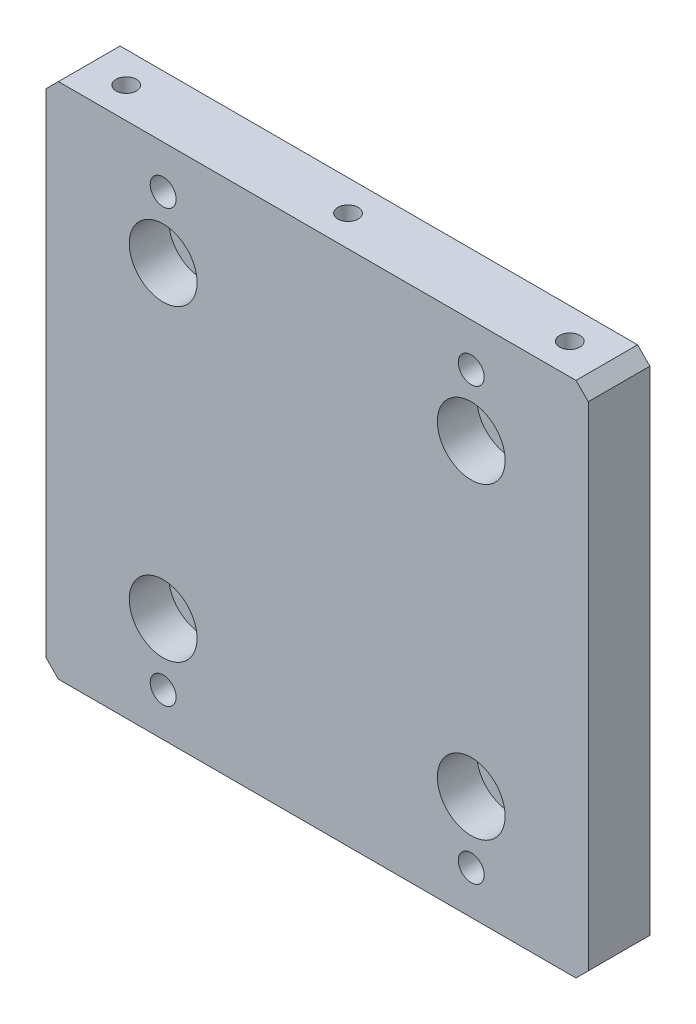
ISO-10303-21;
HEADER;
FILE_DESCRIPTION(('STEP AP214'),'2;1');
FILE_NAME('part.step','',(''),(''),'','','');
FILE_SCHEMA(('AUTOMOTIVE_DESIGN { 1 0 10303 214 1 1 1 1 }'));
ENDSEC;
DATA;
#1=APPLICATION_CONTEXT('core data for automotive mechanical design processes');
#2=APPLICATION_PROTOCOL_DEFINITION('international standard','automotive_design',2000,#1);
#3=PRODUCT_CONTEXT('',#1,'mechanical');
#4=PRODUCT('Part','Part','',(#3));
#5=PRODUCT_RELATED_PRODUCT_CATEGORY('part','',(#4));
#6=PRODUCT_DEFINITION_FORMATION('','',#4);
#7=PRODUCT_DEFINITION_CONTEXT('part definition',#1,'design');
#8=PRODUCT_DEFINITION('design','',#6,#7);
#9=PRODUCT_DEFINITION_SHAPE('','',#8);
#10=(LENGTH_UNIT() NAMED_UNIT(*) SI_UNIT(.MILLI.,.METRE.));
#11=(NAMED_UNIT(*) PLANE_ANGLE_UNIT() SI_UNIT($,.RADIAN.));
#12=(NAMED_UNIT(*) SI_UNIT($,.STERADIAN.) SOLID_ANGLE_UNIT());
#13=UNCERTAINTY_MEASURE_WITH_UNIT(LENGTH_MEASURE(1.E-05),#10,'distance_accuracy_value','');
#14=(GEOMETRIC_REPRESENTATION_CONTEXT(3) GLOBAL_UNCERTAINTY_ASSIGNED_CONTEXT((#13)) GLOBAL_UNIT_ASSIGNED_CONTEXT((#10,
#11,#12)) REPRESENTATION_CONTEXT('',''));
#15=CARTESIAN_POINT('',(0.,0.,0.));
#16=DIRECTION('',(0.,0.,1.));
#17=DIRECTION('',(1.,0.,0.));
#18=AXIS2_PLACEMENT_3D('',#15,#16,#17);
#19=CARTESIAN_POINT('',(-44.0000000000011,42.0000000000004,9.99999999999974));
#20=DIRECTION('',(1.00000000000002,0.,0.));
#21=DIRECTION('',(0.,0.,-1.00000000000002));
#22=AXIS2_PLACEMENT_3D('',#19,#20,#21);
#23=PLANE('',#22);
#24=DIRECTION('',(0.,-1.,0.));
#25=VECTOR('',#24,1.);
#26=CARTESIAN_POINT('',(-44.0000000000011,42.0000000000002,-2.77555756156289E-13));
#27=LINE('',#26,#25);
#28=CARTESIAN_POINT('',(-44.0000000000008,40.0000000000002,0.));
#29=VERTEX_POINT('',#28);
#30=CARTESIAN_POINT('',(-44.0000000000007,-39.9999999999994,0.));
#31=VERTEX_POINT('',#30);
#32=EDGE_CURVE('E214',#29,#31,#27,.T.);
#33=ORIENTED_EDGE('',*,*,#32,.T.);
#34=DIRECTION('',(0.,0.,1.00000000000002));
#35=VECTOR('',#34,1.);
#36=CARTESIAN_POINT('',(-44.0000000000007,-39.9999999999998,10.0000000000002));
#37=LINE('',#36,#35);
#38=CARTESIAN_POINT('',(-44.0000000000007,-39.9999999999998,10.0000000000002));
#39=VERTEX_POINT('',#38);
#40=EDGE_CURVE('E11',#31,#39,#37,.T.);
#41=ORIENTED_EDGE('',*,*,#40,.T.);
#42=DIRECTION('',(0.,-1.,0.));
#43=VECTOR('',#42,1.);
#44=CARTESIAN_POINT('',(-44.0000000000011,42.0000000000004,9.99999999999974));
#45=LINE('',#44,#43);
#46=CARTESIAN_POINT('',(-44.0000000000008,40.0000000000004,10.0000000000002));
#47=VERTEX_POINT('',#46);
#48=EDGE_CURVE('E215',#47,#39,#45,.T.);
#49=ORIENTED_EDGE('',*,*,#48,.F.);
#50=DIRECTION('',(0.,0.,-1.00000000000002));
#51=VECTOR('',#50,1.);
#52=CARTESIAN_POINT('',(-44.0000000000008,40.0000000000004,10.0000000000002));
#53=LINE('',#52,#51);
#54=EDGE_CURVE('E50',#47,#29,#53,.T.);
#55=ORIENTED_EDGE('',*,*,#54,.T.);
#56=EDGE_LOOP('',(#33,#41,#49,#55));
#57=FACE_BOUND('',#56,.T.);
#58=ADVANCED_FACE('F42',(#57),#23,.F.);
#59=CARTESIAN_POINT('',(-44.0000000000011,-41.9999999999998,10.0000000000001));
#60=DIRECTION('',(0.,1.,0.));
#61=DIRECTION('',(-1.00000000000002,0.,0.));
#62=AXIS2_PLACEMENT_3D('',#59,#60,#61);
#63=PLANE('',#62);
#64=DIRECTION('',(1.00000000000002,0.,0.));
#65=VECTOR('',#64,1.);
#66=CARTESIAN_POINT('',(-44.0000000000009,-41.9999999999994,0.));
#67=LINE('',#66,#65);
#68=CARTESIAN_POINT('',(-42.0000000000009,-41.9999999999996,-5.13478148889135E-13));
#69=VERTEX_POINT('',#68);
#70=CARTESIAN_POINT('',(42.0000000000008,-41.9999999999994,-4.44089209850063E-13));
#71=VERTEX_POINT('',#70);
#72=EDGE_CURVE('E229',#69,#71,#67,.T.);
#73=ORIENTED_EDGE('',*,*,#72,.T.);
#74=DIRECTION('',(0.,0.,1.00000000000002));
#75=VECTOR('',#74,1.);
#76=CARTESIAN_POINT('',(42.0000000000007,-41.9999999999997,9.99999999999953));
#77=LINE('',#76,#75);
#78=CARTESIAN_POINT('',(42.0000000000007,-41.9999999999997,9.99999999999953));
#79=VERTEX_POINT('',#78);
#80=EDGE_CURVE('E251',#71,#79,#77,.T.);
#81=ORIENTED_EDGE('',*,*,#80,.T.);
#82=DIRECTION('',(1.00000000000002,0.,0.));
#83=VECTOR('',#82,1.);
#84=CARTESIAN_POINT('',(-44.0000000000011,-41.9999999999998,10.0000000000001));
#85=LINE('',#84,#83);
#86=CARTESIAN_POINT('',(-42.0000000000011,-41.9999999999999,9.99999999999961));
#87=VERTEX_POINT('',#86);
#88=EDGE_CURVE('E218',#87,#79,#85,.T.);
#89=ORIENTED_EDGE('',*,*,#88,.F.);
#90=DIRECTION('',(0.,0.,-1.00000000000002));
#91=VECTOR('',#90,1.);
#92=CARTESIAN_POINT('',(-42.0000000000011,-41.9999999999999,9.99999999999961));
#93=LINE('',#92,#91);
#94=EDGE_CURVE('E248',#87,#69,#93,.T.);
#95=ORIENTED_EDGE('',*,*,#94,.T.);
#96=EDGE_LOOP('',(#73,#81,#89,#95));
#97=FACE_BOUND('',#96,.T.);
#98=ADVANCED_FACE('F282',(#97),#63,.F.);
#99=CARTESIAN_POINT('',(44.0000000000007,42.0000000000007,9.99999999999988));
#100=DIRECTION('',(-1.00000000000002,0.,0.));
#101=DIRECTION('',(0.,0.,1.00000000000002));
#102=AXIS2_PLACEMENT_3D('',#99,#100,#101);
#103=PLANE('',#102);
#104=DIRECTION('',(0.,1.,0.));
#105=VECTOR('',#104,1.);
#106=CARTESIAN_POINT('',(44.0000000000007,42.0000000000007,9.99999999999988));
#107=LINE('',#106,#105);
#108=CARTESIAN_POINT('',(44.0000000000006,-39.9999999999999,10.0000000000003));
#109=VERTEX_POINT('',#108);
#110=CARTESIAN_POINT('',(44.000000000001,40.0000000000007,10.0000000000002));
#111=VERTEX_POINT('',#110);
#112=EDGE_CURVE('E222',#109,#111,#107,.T.);
#113=ORIENTED_EDGE('',*,*,#112,.F.);
#114=DIRECTION('',(0.,0.,-1.00000000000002));
#115=VECTOR('',#114,1.);
#116=CARTESIAN_POINT('',(44.0000000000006,-39.9999999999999,10.0000000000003));
#117=LINE('',#116,#115);
#118=CARTESIAN_POINT('',(44.0000000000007,-39.9999999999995,1.94289029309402E-13));
#119=VERTEX_POINT('',#118);
#120=EDGE_CURVE('E237',#109,#119,#117,.T.);
#121=ORIENTED_EDGE('',*,*,#120,.T.);
#122=DIRECTION('',(0.,1.,0.));
#123=VECTOR('',#122,1.);
#124=CARTESIAN_POINT('',(44.0000000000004,42.0000000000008,-1.38777878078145E-13));
#125=LINE('',#124,#123);
#126=CARTESIAN_POINT('',(44.000000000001,40.0000000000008,2.22044604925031E-13));
#127=VERTEX_POINT('',#126);
#128=EDGE_CURVE('E232',#119,#127,#125,.T.);
#129=ORIENTED_EDGE('',*,*,#128,.T.);
#130=DIRECTION('',(0.,0.,1.00000000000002));
#131=VECTOR('',#130,1.);
#132=CARTESIAN_POINT('',(44.000000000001,40.0000000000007,10.0000000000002));
#133=LINE('',#132,#131);
#134=EDGE_CURVE('E226',#127,#111,#133,.T.);
#135=ORIENTED_EDGE('',*,*,#134,.T.);
#136=EDGE_LOOP('',(#113,#121,#129,#135));
#137=FACE_BOUND('',#136,.T.);
#138=ADVANCED_FACE('F291',(#137),#103,.F.);
#139=CARTESIAN_POINT('',(-44.0000000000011,42.0000000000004,9.99999999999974));
#140=DIRECTION('',(0.,-1.,0.));
#141=DIRECTION('',(1.00000000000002,0.,0.));
#142=AXIS2_PLACEMENT_3D('',#139,#140,#141);
#143=PLANE('',#142);
#144=CARTESIAN_POINT('',(36.0000000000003,42.0000000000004,4.99999999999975));
#145=DIRECTION('',(0.,1.,0.));
#146=DIRECTION('',(0.,0.,1.00000000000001));
#147=AXIS2_PLACEMENT_3D('',#144,#145,#146);
#148=CIRCLE('',#147,1.64999999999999);
#149=CARTESIAN_POINT('',(36.0000000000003,42.0000000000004,6.64999999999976));
#150=VERTEX_POINT('',#149);
#151=EDGE_CURVE('E126',#150,#150,#148,.T.);
#152=ORIENTED_EDGE('',*,*,#151,.F.);
#153=EDGE_LOOP('',(#152));
#154=FACE_BOUND('',#153,.T.);
#155=CARTESIAN_POINT('',(-2.22044604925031E-13,42.0000000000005,4.99999999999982));
#156=DIRECTION('',(0.,1.,0.));
#157=DIRECTION('',(0.,0.,1.00000000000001));
#158=AXIS2_PLACEMENT_3D('',#155,#156,#157);
#159=CIRCLE('',#158,1.64999999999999);
#160=CARTESIAN_POINT('',(-2.22044604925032E-13,42.0000000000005,6.64999999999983));
#161=VERTEX_POINT('',#160);
#162=EDGE_CURVE('E125',#161,#161,#159,.T.);
#163=ORIENTED_EDGE('',*,*,#162,.F.);
#164=EDGE_LOOP('',(#163));
#165=FACE_BOUND('',#164,.T.);
#166=CARTESIAN_POINT('',(-36.0000000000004,41.9999999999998,4.99999999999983));
#167=DIRECTION('',(0.,1.,0.));
#168=DIRECTION('',(0.,0.,1.00000000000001));
#169=AXIS2_PLACEMENT_3D('',#166,#167,#168);
#170=CIRCLE('',#169,1.64999999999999);
#171=CARTESIAN_POINT('',(-36.0000000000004,41.9999999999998,6.64999999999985));
#172=VERTEX_POINT('',#171);
#173=EDGE_CURVE('E136',#172,#172,#170,.T.);
#174=ORIENTED_EDGE('',*,*,#173,.F.);
#175=EDGE_LOOP('',(#174));
#176=FACE_BOUND('',#175,.T.);
#177=DIRECTION('',(-1.00000000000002,0.,0.));
#178=VECTOR('',#177,1.);
#179=CARTESIAN_POINT('',(-44.0000000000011,42.0000000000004,9.99999999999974));
#180=LINE('',#179,#178);
#181=CARTESIAN_POINT('',(42.0000000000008,42.0000000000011,9.99999999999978));
#182=VERTEX_POINT('',#181);
#183=CARTESIAN_POINT('',(-42.0000000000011,42.0000000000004,9.9999999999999));
#184=VERTEX_POINT('',#183);
#185=EDGE_CURVE('E224',#182,#184,#180,.T.);
#186=ORIENTED_EDGE('',*,*,#185,.F.);
#187=DIRECTION('',(0.,0.,-1.00000000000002));
#188=VECTOR('',#187,1.);
#189=CARTESIAN_POINT('',(42.0000000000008,42.0000000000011,9.99999999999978));
#190=LINE('',#189,#188);
#191=CARTESIAN_POINT('',(42.0000000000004,42.0000000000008,-1.66533453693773E-13));
#192=VERTEX_POINT('',#191);
#193=EDGE_CURVE('E261',#182,#192,#190,.T.);
#194=ORIENTED_EDGE('',*,*,#193,.T.);
#195=DIRECTION('',(-1.00000000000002,0.,0.));
#196=VECTOR('',#195,1.);
#197=CARTESIAN_POINT('',(-44.0000000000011,42.0000000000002,-2.77555756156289E-13));
#198=LINE('',#197,#196);
#199=CARTESIAN_POINT('',(-42.0000000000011,42.0000000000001,-1.2490009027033E-13));
#200=VERTEX_POINT('',#199);
#201=EDGE_CURVE('E219',#192,#200,#198,.T.);
#202=ORIENTED_EDGE('',*,*,#201,.T.);
#203=DIRECTION('',(0.,0.,1.00000000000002));
#204=VECTOR('',#203,1.);
#205=CARTESIAN_POINT('',(-42.0000000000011,42.0000000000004,9.9999999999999));
#206=LINE('',#205,#204);
#207=EDGE_CURVE('E57',#200,#184,#206,.T.);
#208=ORIENTED_EDGE('',*,*,#207,.T.);
#209=EDGE_LOOP('',(#186,#194,#202,#208));
#210=FACE_BOUND('',#209,.T.);
#211=ADVANCED_FACE('F296',(#154,#165,#176,#210),#143,.F.);
#212=CARTESIAN_POINT('',(-2.77555756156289E-13,3.88578058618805E-13,10.0000000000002));
#213=DIRECTION('',(0.,0.,1.00000000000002));
#214=DIRECTION('',(1.00000000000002,0.,0.));
#215=AXIS2_PLACEMENT_3D('',#212,#213,#214);
#216=PLANE('',#215);
#217=CARTESIAN_POINT('',(-25.0000000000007,35.0000000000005,10.0000000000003));
#218=DIRECTION('',(0.,0.,1.00000000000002));
#219=DIRECTION('',(1.00000000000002,0.,0.));
#220=AXIS2_PLACEMENT_3D('',#217,#218,#219);
#221=CIRCLE('',#220,2.09999999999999);
#222=CARTESIAN_POINT('',(-22.9000000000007,35.0000000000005,10.0000000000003));
#223=VERTEX_POINT('',#222);
#224=EDGE_CURVE('E142',#223,#223,#221,.T.);
#225=ORIENTED_EDGE('',*,*,#224,.F.);
#226=EDGE_LOOP('',(#225));
#227=FACE_BOUND('',#226,.T.);
#228=CARTESIAN_POINT('',(25.0000000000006,35.0000000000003,10.0000000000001));
#229=DIRECTION('',(0.,0.,1.00000000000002));
#230=DIRECTION('',(1.00000000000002,0.,0.));
#231=AXIS2_PLACEMENT_3D('',#228,#229,#230);
#232=CIRCLE('',#231,2.09999999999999);
#233=CARTESIAN_POINT('',(27.1000000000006,35.0000000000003,10.0000000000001));
#234=VERTEX_POINT('',#233);
#235=EDGE_CURVE('E148',#234,#234,#232,.T.);
#236=ORIENTED_EDGE('',*,*,#235,.F.);
#237=EDGE_LOOP('',(#236));
#238=FACE_BOUND('',#237,.T.);
#239=CARTESIAN_POINT('',(25.0000000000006,-34.9999999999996,10.0000000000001));
#240=DIRECTION('',(0.,0.,1.00000000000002));
#241=DIRECTION('',(1.00000000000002,0.,0.));
#242=AXIS2_PLACEMENT_3D('',#239,#240,#241);
#243=CIRCLE('',#242,2.09999999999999);
#244=CARTESIAN_POINT('',(27.1000000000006,-34.9999999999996,10.0000000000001));
#245=VERTEX_POINT('',#244);
#246=EDGE_CURVE('E154',#245,#245,#243,.T.);
#247=ORIENTED_EDGE('',*,*,#246,.F.);
#248=EDGE_LOOP('',(#247));
#249=FACE_BOUND('',#248,.T.);
#250=CARTESIAN_POINT('',(-25.0000000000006,-34.9999999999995,10.0000000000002));
#251=DIRECTION('',(0.,0.,1.00000000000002));
#252=DIRECTION('',(1.00000000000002,0.,0.));
#253=AXIS2_PLACEMENT_3D('',#250,#251,#252);
#254=CIRCLE('',#253,2.09999999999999);
#255=CARTESIAN_POINT('',(-22.9000000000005,-34.9999999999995,10.0000000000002));
#256=VERTEX_POINT('',#255);
#257=EDGE_CURVE('E160',#256,#256,#254,.T.);
#258=ORIENTED_EDGE('',*,*,#257,.F.);
#259=EDGE_LOOP('',(#258));
#260=FACE_BOUND('',#259,.T.);
#261=CARTESIAN_POINT('',(25.0000000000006,25.0000000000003,10.));
#262=DIRECTION('',(0.,0.,1.00000000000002));
#263=DIRECTION('',(1.00000000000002,0.,0.));
#264=AXIS2_PLACEMENT_3D('',#261,#262,#263);
#265=CIRCLE('',#264,5.5);
#266=CARTESIAN_POINT('',(30.5000000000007,25.0000000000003,10.));
#267=VERTEX_POINT('',#266);
#268=EDGE_CURVE('E166',#267,#267,#265,.T.);
#269=ORIENTED_EDGE('',*,*,#268,.F.);
#270=EDGE_LOOP('',(#269));
#271=FACE_BOUND('',#270,.T.);
#272=CARTESIAN_POINT('',(25.0000000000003,-24.9999999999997,10.0000000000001));
#273=DIRECTION('',(0.,0.,1.00000000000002));
#274=DIRECTION('',(1.00000000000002,0.,0.));
#275=AXIS2_PLACEMENT_3D('',#272,#273,#274);
#276=CIRCLE('',#275,5.5);
#277=CARTESIAN_POINT('',(30.5000000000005,-24.9999999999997,10.0000000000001));
#278=VERTEX_POINT('',#277);
#279=EDGE_CURVE('E178',#278,#278,#276,.T.);
#280=ORIENTED_EDGE('',*,*,#279,.F.);
#281=EDGE_LOOP('',(#280));
#282=FACE_BOUND('',#281,.T.);
#283=CARTESIAN_POINT('',(-25.0000000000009,-24.9999999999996,10.));
#284=DIRECTION('',(0.,0.,1.00000000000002));
#285=DIRECTION('',(1.00000000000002,0.,0.));
#286=AXIS2_PLACEMENT_3D('',#283,#284,#285);
#287=CIRCLE('',#286,5.5);
#288=CARTESIAN_POINT('',(-19.5000000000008,-24.9999999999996,10.));
#289=VERTEX_POINT('',#288);
#290=EDGE_CURVE('E190',#289,#289,#287,.T.);
#291=ORIENTED_EDGE('',*,*,#290,.F.);
#292=EDGE_LOOP('',(#291));
#293=FACE_BOUND('',#292,.T.);
#294=CARTESIAN_POINT('',(-25.0000000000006,25.0000000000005,9.99999999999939));
#295=DIRECTION('',(0.,0.,1.00000000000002));
#296=DIRECTION('',(1.00000000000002,0.,0.));
#297=AXIS2_PLACEMENT_3D('',#294,#295,#296);
#298=CIRCLE('',#297,5.5);
#299=CARTESIAN_POINT('',(-19.5000000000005,25.0000000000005,9.99999999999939));
#300=VERTEX_POINT('',#299);
#301=EDGE_CURVE('E202',#300,#300,#298,.T.);
#302=ORIENTED_EDGE('',*,*,#301,.F.);
#303=EDGE_LOOP('',(#302));
#304=FACE_BOUND('',#303,.T.);
#305=ORIENTED_EDGE('',*,*,#88,.T.);
#306=DIRECTION('',(-0.707106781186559,-0.707106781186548,0.));
#307=VECTOR('',#306,1.);
#308=CARTESIAN_POINT('',(42.0000000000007,-41.9999999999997,9.99999999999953));
#309=LINE('',#308,#307);
#310=EDGE_CURVE('E258',#79,#109,#309,.F.);
#311=ORIENTED_EDGE('',*,*,#310,.T.);
#312=ORIENTED_EDGE('',*,*,#112,.T.);
#313=DIRECTION('',(0.707106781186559,-0.707106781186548,0.));
#314=VECTOR('',#313,1.);
#315=CARTESIAN_POINT('',(42.0000000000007,42.0000000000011,9.99999999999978));
#316=LINE('',#315,#314);
#317=EDGE_CURVE('E64',#111,#182,#316,.F.);
#318=ORIENTED_EDGE('',*,*,#317,.T.);
#319=ORIENTED_EDGE('',*,*,#185,.T.);
#320=DIRECTION('',(0.707106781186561,0.707106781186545,0.));
#321=VECTOR('',#320,1.);
#322=CARTESIAN_POINT('',(-42.000000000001,42.0000000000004,9.9999999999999));
#323=LINE('',#322,#321);
#324=EDGE_CURVE('E253',#184,#47,#323,.F.);
#325=ORIENTED_EDGE('',*,*,#324,.T.);
#326=ORIENTED_EDGE('',*,*,#48,.T.);
#327=DIRECTION('',(-0.707106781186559,0.707106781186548,0.));
#328=VECTOR('',#327,1.);
#329=CARTESIAN_POINT('',(-42.0000000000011,-41.9999999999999,9.99999999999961));
#330=LINE('',#329,#328);
#331=EDGE_CURVE('E255',#39,#87,#330,.F.);
#332=ORIENTED_EDGE('',*,*,#331,.T.);
#333=EDGE_LOOP('',(#305,#311,#312,#318,#319,#325,#326,#332));
#334=FACE_BOUND('',#333,.T.);
#335=ADVANCED_FACE('F285',(#227,#238,#249,#260,#271,#282,#293,#304,#334),#216,.T.);
#336=CARTESIAN_POINT('',(0.,0.,0.));
#337=DIRECTION('',(0.,0.,1.00000000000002));
#338=DIRECTION('',(1.00000000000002,0.,0.));
#339=AXIS2_PLACEMENT_3D('',#336,#337,#338);
#340=PLANE('',#339);
#341=CARTESIAN_POINT('',(-25.0000000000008,35.,2.77555756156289E-13));
#342=DIRECTION('',(0.,0.,1.00000000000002));
#343=DIRECTION('',(1.00000000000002,0.,0.));
#344=AXIS2_PLACEMENT_3D('',#341,#342,#343);
#345=CIRCLE('',#344,2.09999999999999);
#346=CARTESIAN_POINT('',(-22.9000000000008,35.,2.77555756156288E-13));
#347=VERTEX_POINT('',#346);
#348=EDGE_CURVE('E145',#347,#347,#345,.T.);
#349=ORIENTED_EDGE('',*,*,#348,.T.);
#350=EDGE_LOOP('',(#349));
#351=FACE_BOUND('',#350,.T.);
#352=CARTESIAN_POINT('',(25.0000000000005,35.,1.38777878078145E-13));
#353=DIRECTION('',(0.,0.,1.00000000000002));
#354=DIRECTION('',(1.00000000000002,0.,0.));
#355=AXIS2_PLACEMENT_3D('',#352,#353,#354);
#356=CIRCLE('',#355,2.09999999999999);
#357=CARTESIAN_POINT('',(27.1000000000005,35.,1.38777878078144E-13));
#358=VERTEX_POINT('',#357);
#359=EDGE_CURVE('E151',#358,#358,#356,.T.);
#360=ORIENTED_EDGE('',*,*,#359,.T.);
#361=EDGE_LOOP('',(#360));
#362=FACE_BOUND('',#361,.T.);
#363=CARTESIAN_POINT('',(25.0000000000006,-34.9999999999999,0.));
#364=DIRECTION('',(0.,0.,1.00000000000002));
#365=DIRECTION('',(1.00000000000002,0.,0.));
#366=AXIS2_PLACEMENT_3D('',#363,#364,#365);
#367=CIRCLE('',#366,2.09999999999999);
#368=CARTESIAN_POINT('',(27.1000000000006,-34.9999999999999,0.));
#369=VERTEX_POINT('',#368);
#370=EDGE_CURVE('E157',#369,#369,#367,.T.);
#371=ORIENTED_EDGE('',*,*,#370,.T.);
#372=EDGE_LOOP('',(#371));
#373=FACE_BOUND('',#372,.T.);
#374=CARTESIAN_POINT('',(-25.0000000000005,-35.,1.52655665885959E-13));
#375=DIRECTION('',(0.,0.,1.00000000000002));
#376=DIRECTION('',(1.00000000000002,0.,0.));
#377=AXIS2_PLACEMENT_3D('',#374,#375,#376);
#378=CIRCLE('',#377,2.09999999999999);
#379=CARTESIAN_POINT('',(-22.9000000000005,-35.,1.52655665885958E-13));
#380=VERTEX_POINT('',#379);
#381=EDGE_CURVE('E163',#380,#380,#378,.T.);
#382=ORIENTED_EDGE('',*,*,#381,.T.);
#383=EDGE_LOOP('',(#382));
#384=FACE_BOUND('',#383,.T.);
#385=CARTESIAN_POINT('',(25.0000000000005,25.0000000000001,0.));
#386=DIRECTION('',(0.,0.,1.00000000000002));
#387=DIRECTION('',(1.00000000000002,0.,0.));
#388=AXIS2_PLACEMENT_3D('',#385,#386,#387);
#389=CIRCLE('',#388,3.2);
#390=CARTESIAN_POINT('',(28.2000000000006,25.0000000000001,0.));
#391=VERTEX_POINT('',#390);
#392=EDGE_CURVE('E175',#391,#391,#389,.T.);
#393=ORIENTED_EDGE('',*,*,#392,.T.);
#394=EDGE_LOOP('',(#393));
#395=FACE_BOUND('',#394,.T.);
#396=CARTESIAN_POINT('',(25.0000000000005,-25.,0.));
#397=DIRECTION('',(0.,0.,1.00000000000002));
#398=DIRECTION('',(1.00000000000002,0.,0.));
#399=AXIS2_PLACEMENT_3D('',#396,#397,#398);
#400=CIRCLE('',#399,3.2);
#401=CARTESIAN_POINT('',(28.2000000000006,-25.,0.));
#402=VERTEX_POINT('',#401);
#403=EDGE_CURVE('E187',#402,#402,#400,.T.);
#404=ORIENTED_EDGE('',*,*,#403,.T.);
#405=EDGE_LOOP('',(#404));
#406=FACE_BOUND('',#405,.T.);
#407=CARTESIAN_POINT('',(-25.0000000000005,-25.,-5.41233724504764E-13));
#408=DIRECTION('',(0.,0.,1.00000000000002));
#409=DIRECTION('',(1.00000000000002,0.,0.));
#410=AXIS2_PLACEMENT_3D('',#407,#408,#409);
#411=CIRCLE('',#410,3.2);
#412=CARTESIAN_POINT('',(-21.8000000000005,-25.,-5.41233724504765E-13));
#413=VERTEX_POINT('',#412);
#414=EDGE_CURVE('E199',#413,#413,#411,.T.);
#415=ORIENTED_EDGE('',*,*,#414,.T.);
#416=EDGE_LOOP('',(#415));
#417=FACE_BOUND('',#416,.T.);
#418=CARTESIAN_POINT('',(-25.0000000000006,25.,-5.82867087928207E-13));
#419=DIRECTION('',(0.,0.,1.00000000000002));
#420=DIRECTION('',(1.00000000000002,0.,0.));
#421=AXIS2_PLACEMENT_3D('',#418,#419,#420);
#422=CIRCLE('',#421,3.2);
#423=CARTESIAN_POINT('',(-21.8000000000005,25.,-5.82867087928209E-13));
#424=VERTEX_POINT('',#423);
#425=EDGE_CURVE('E211',#424,#424,#422,.T.);
#426=ORIENTED_EDGE('',*,*,#425,.T.);
#427=EDGE_LOOP('',(#426));
#428=FACE_BOUND('',#427,.T.);
#429=ORIENTED_EDGE('',*,*,#128,.F.);
#430=DIRECTION('',(0.707106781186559,0.707106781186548,0.));
#431=VECTOR('',#430,1.);
#432=CARTESIAN_POINT('',(44.0000000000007,-39.9999999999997,1.94289029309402E-13));
#433=LINE('',#432,#431);
#434=EDGE_CURVE('E246',#119,#71,#433,.F.);
#435=ORIENTED_EDGE('',*,*,#434,.T.);
#436=ORIENTED_EDGE('',*,*,#72,.F.);
#437=DIRECTION('',(0.707106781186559,-0.707106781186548,0.));
#438=VECTOR('',#437,1.);
#439=CARTESIAN_POINT('',(-42.0000000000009,-41.9999999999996,-5.13478148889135E-13));
#440=LINE('',#439,#438);
#441=EDGE_CURVE('E242',#69,#31,#440,.F.);
#442=ORIENTED_EDGE('',*,*,#441,.T.);
#443=ORIENTED_EDGE('',*,*,#32,.F.);
#444=DIRECTION('',(-0.707106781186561,-0.707106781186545,0.));
#445=VECTOR('',#444,1.);
#446=CARTESIAN_POINT('',(-44.0000000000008,40.0000000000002,0.));
#447=LINE('',#446,#445);
#448=EDGE_CURVE('E240',#29,#200,#447,.F.);
#449=ORIENTED_EDGE('',*,*,#448,.T.);
#450=ORIENTED_EDGE('',*,*,#201,.F.);
#451=DIRECTION('',(-0.707106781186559,0.707106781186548,0.));
#452=VECTOR('',#451,1.);
#453=CARTESIAN_POINT('',(42.0000000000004,42.0000000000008,-1.66533453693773E-13));
#454=LINE('',#453,#452);
#455=EDGE_CURVE('E244',#192,#127,#454,.F.);
#456=ORIENTED_EDGE('',*,*,#455,.T.);
#457=EDGE_LOOP('',(#429,#435,#436,#442,#443,#449,#450,#456));
#458=FACE_BOUND('',#457,.T.);
#459=ADVANCED_FACE('F273',(#351,#362,#373,#384,#395,#406,#417,#428,#458),#340,.F.);
#460=CARTESIAN_POINT('',(-25.0000000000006,25.0000000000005,9.99999999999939));
#461=DIRECTION('',(0.,0.,1.00000000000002));
#462=DIRECTION('',(1.00000000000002,0.,0.));
#463=AXIS2_PLACEMENT_3D('',#460,#461,#462);
#464=CYLINDRICAL_SURFACE('',#463,3.2);
#465=ORIENTED_EDGE('',*,*,#425,.F.);
#466=EDGE_LOOP('',(#465));
#467=FACE_BOUND('',#466,.T.);
#468=CARTESIAN_POINT('',(-25.0000000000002,25.,3.59999999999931));
#469=DIRECTION('',(0.,0.,1.00000000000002));
#470=DIRECTION('',(1.00000000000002,0.,0.));
#471=AXIS2_PLACEMENT_3D('',#468,#469,#470);
#472=CIRCLE('',#471,3.2);
#473=CARTESIAN_POINT('',(-21.8000000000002,25.,3.59999999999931));
#474=VERTEX_POINT('',#473);
#475=EDGE_CURVE('E208',#474,#474,#472,.T.);
#476=ORIENTED_EDGE('',*,*,#475,.T.);
#477=EDGE_LOOP('',(#476));
#478=FACE_BOUND('',#477,.T.);
#479=ADVANCED_FACE('F532',(#467,#478),#464,.F.);
#480=CARTESIAN_POINT('',(-21.8000000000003,25.,3.59999999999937));
#481=DIRECTION('',(0.,0.,-1.00000000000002));
#482=DIRECTION('',(-1.00000000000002,0.,0.));
#483=AXIS2_PLACEMENT_3D('',#480,#481,#482);
#484=PLANE('',#483);
#485=ORIENTED_EDGE('',*,*,#475,.F.);
#486=EDGE_LOOP('',(#485));
#487=FACE_BOUND('',#486,.T.);
#488=CARTESIAN_POINT('',(-25.0000000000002,25.,3.59999999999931));
#489=DIRECTION('',(0.,0.,1.00000000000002));
#490=DIRECTION('',(1.00000000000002,0.,0.));
#491=AXIS2_PLACEMENT_3D('',#488,#489,#490);
#492=CIRCLE('',#491,5.5);
#493=CARTESIAN_POINT('',(-19.5000000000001,25.,3.59999999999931));
#494=VERTEX_POINT('',#493);
#495=EDGE_CURVE('E205',#494,#494,#492,.T.);
#496=ORIENTED_EDGE('',*,*,#495,.T.);
#497=EDGE_LOOP('',(#496));
#498=FACE_BOUND('',#497,.T.);
#499=ADVANCED_FACE('F524',(#487,#498),#484,.F.);
#500=CARTESIAN_POINT('',(-25.0000000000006,25.0000000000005,9.99999999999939));
#501=DIRECTION('',(0.,0.,1.00000000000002));
#502=DIRECTION('',(1.00000000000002,0.,0.));
#503=AXIS2_PLACEMENT_3D('',#500,#501,#502);
#504=CYLINDRICAL_SURFACE('',#503,5.5);
#505=ORIENTED_EDGE('',*,*,#495,.F.);
#506=EDGE_LOOP('',(#505));
#507=FACE_BOUND('',#506,.T.);
#508=ORIENTED_EDGE('',*,*,#301,.T.);
#509=EDGE_LOOP('',(#508));
#510=FACE_BOUND('',#509,.T.);
#511=ADVANCED_FACE('F516',(#507,#510),#504,.F.);
#512=CARTESIAN_POINT('',(-25.0000000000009,-24.9999999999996,10.));
#513=DIRECTION('',(0.,0.,1.00000000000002));
#514=DIRECTION('',(1.00000000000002,0.,0.));
#515=AXIS2_PLACEMENT_3D('',#512,#513,#514);
#516=CYLINDRICAL_SURFACE('',#515,3.2);
#517=ORIENTED_EDGE('',*,*,#414,.F.);
#518=EDGE_LOOP('',(#517));
#519=FACE_BOUND('',#518,.T.);
#520=CARTESIAN_POINT('',(-25.0000000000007,-25.,3.59999999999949));
#521=DIRECTION('',(0.,0.,1.00000000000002));
#522=DIRECTION('',(1.00000000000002,0.,0.));
#523=AXIS2_PLACEMENT_3D('',#520,#521,#522);
#524=CIRCLE('',#523,3.2);
#525=CARTESIAN_POINT('',(-21.8000000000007,-25.,3.59999999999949));
#526=VERTEX_POINT('',#525);
#527=EDGE_CURVE('E196',#526,#526,#524,.T.);
#528=ORIENTED_EDGE('',*,*,#527,.T.);
#529=EDGE_LOOP('',(#528));
#530=FACE_BOUND('',#529,.T.);
#531=ADVANCED_FACE('F508',(#519,#530),#516,.F.);
#532=CARTESIAN_POINT('',(-21.8000000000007,-25.,3.59999999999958));
#533=DIRECTION('',(0.,0.,-1.00000000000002));
#534=DIRECTION('',(-1.00000000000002,0.,0.));
#535=AXIS2_PLACEMENT_3D('',#532,#533,#534);
#536=PLANE('',#535);
#537=ORIENTED_EDGE('',*,*,#527,.F.);
#538=EDGE_LOOP('',(#537));
#539=FACE_BOUND('',#538,.T.);
#540=CARTESIAN_POINT('',(-25.0000000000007,-25.,3.59999999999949));
#541=DIRECTION('',(0.,0.,1.00000000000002));
#542=DIRECTION('',(1.00000000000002,0.,0.));
#543=AXIS2_PLACEMENT_3D('',#540,#541,#542);
#544=CIRCLE('',#543,5.5);
#545=CARTESIAN_POINT('',(-19.5000000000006,-25.,3.59999999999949));
#546=VERTEX_POINT('',#545);
#547=EDGE_CURVE('E193',#546,#546,#544,.T.);
#548=ORIENTED_EDGE('',*,*,#547,.T.);
#549=EDGE_LOOP('',(#548));
#550=FACE_BOUND('',#549,.T.);
#551=ADVANCED_FACE('F500',(#539,#550),#536,.F.);
#552=CARTESIAN_POINT('',(-25.0000000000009,-24.9999999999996,10.));
#553=DIRECTION('',(0.,0.,1.00000000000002));
#554=DIRECTION('',(1.00000000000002,0.,0.));
#555=AXIS2_PLACEMENT_3D('',#552,#553,#554);
#556=CYLINDRICAL_SURFACE('',#555,5.5);
#557=ORIENTED_EDGE('',*,*,#547,.F.);
#558=EDGE_LOOP('',(#557));
#559=FACE_BOUND('',#558,.T.);
#560=ORIENTED_EDGE('',*,*,#290,.T.);
#561=EDGE_LOOP('',(#560));
#562=FACE_BOUND('',#561,.T.);
#563=ADVANCED_FACE('F492',(#559,#562),#556,.F.);
#564=CARTESIAN_POINT('',(25.0000000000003,-24.9999999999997,10.0000000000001));
#565=DIRECTION('',(0.,0.,1.00000000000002));
#566=DIRECTION('',(1.00000000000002,0.,0.));
#567=AXIS2_PLACEMENT_3D('',#564,#565,#566);
#568=CYLINDRICAL_SURFACE('',#567,3.2);
#569=ORIENTED_EDGE('',*,*,#403,.F.);
#570=EDGE_LOOP('',(#569));
#571=FACE_BOUND('',#570,.T.);
#572=CARTESIAN_POINT('',(25.0000000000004,-25.,3.60000000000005));
#573=DIRECTION('',(0.,0.,1.00000000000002));
#574=DIRECTION('',(1.00000000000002,0.,0.));
#575=AXIS2_PLACEMENT_3D('',#572,#573,#574);
#576=CIRCLE('',#575,3.2);
#577=CARTESIAN_POINT('',(28.2000000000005,-25.,3.60000000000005));
#578=VERTEX_POINT('',#577);
#579=EDGE_CURVE('E184',#578,#578,#576,.T.);
#580=ORIENTED_EDGE('',*,*,#579,.T.);
#581=EDGE_LOOP('',(#580));
#582=FACE_BOUND('',#581,.T.);
#583=ADVANCED_FACE('F484',(#571,#582),#568,.F.);
#584=CARTESIAN_POINT('',(28.2000000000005,-24.9999999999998,3.60000000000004));
#585=DIRECTION('',(0.,0.,-1.00000000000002));
#586=DIRECTION('',(-1.00000000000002,0.,0.));
#587=AXIS2_PLACEMENT_3D('',#584,#585,#586);
#588=PLANE('',#587);
#589=ORIENTED_EDGE('',*,*,#579,.F.);
#590=EDGE_LOOP('',(#589));
#591=FACE_BOUND('',#590,.T.);
#592=CARTESIAN_POINT('',(25.0000000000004,-25.,3.60000000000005));
#593=DIRECTION('',(0.,0.,1.00000000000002));
#594=DIRECTION('',(1.00000000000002,0.,0.));
#595=AXIS2_PLACEMENT_3D('',#592,#593,#594);
#596=CIRCLE('',#595,5.5);
#597=CARTESIAN_POINT('',(30.5000000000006,-25.,3.60000000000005));
#598=VERTEX_POINT('',#597);
#599=EDGE_CURVE('E181',#598,#598,#596,.T.);
#600=ORIENTED_EDGE('',*,*,#599,.T.);
#601=EDGE_LOOP('',(#600));
#602=FACE_BOUND('',#601,.T.);
#603=ADVANCED_FACE('F476',(#591,#602),#588,.F.);
#604=CARTESIAN_POINT('',(25.0000000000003,-24.9999999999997,10.0000000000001));
#605=DIRECTION('',(0.,0.,1.00000000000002));
#606=DIRECTION('',(1.00000000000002,0.,0.));
#607=AXIS2_PLACEMENT_3D('',#604,#605,#606);
#608=CYLINDRICAL_SURFACE('',#607,5.5);
#609=ORIENTED_EDGE('',*,*,#599,.F.);
#610=EDGE_LOOP('',(#609));
#611=FACE_BOUND('',#610,.T.);
#612=ORIENTED_EDGE('',*,*,#279,.T.);
#613=EDGE_LOOP('',(#612));
#614=FACE_BOUND('',#613,.T.);
#615=ADVANCED_FACE('F468',(#611,#614),#608,.F.);
#616=CARTESIAN_POINT('',(25.0000000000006,25.0000000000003,10.));
#617=DIRECTION('',(0.,0.,1.00000000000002));
#618=DIRECTION('',(1.00000000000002,0.,0.));
#619=AXIS2_PLACEMENT_3D('',#616,#617,#618);
#620=CYLINDRICAL_SURFACE('',#619,3.2);
#621=ORIENTED_EDGE('',*,*,#392,.F.);
#622=EDGE_LOOP('',(#621));
#623=FACE_BOUND('',#622,.T.);
#624=CARTESIAN_POINT('',(25.0000000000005,24.9999999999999,3.59999999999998));
#625=DIRECTION('',(0.,0.,1.00000000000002));
#626=DIRECTION('',(1.00000000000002,0.,0.));
#627=AXIS2_PLACEMENT_3D('',#624,#625,#626);
#628=CIRCLE('',#627,3.2);
#629=CARTESIAN_POINT('',(28.2000000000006,24.9999999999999,3.59999999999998));
#630=VERTEX_POINT('',#629);
#631=EDGE_CURVE('E172',#630,#630,#628,.T.);
#632=ORIENTED_EDGE('',*,*,#631,.T.);
#633=EDGE_LOOP('',(#632));
#634=FACE_BOUND('',#633,.T.);
#635=ADVANCED_FACE('F460',(#623,#634),#620,.F.);
#636=CARTESIAN_POINT('',(28.2000000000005,25.,3.59999999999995));
#637=DIRECTION('',(0.,0.,-1.00000000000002));
#638=DIRECTION('',(-1.00000000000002,0.,0.));
#639=AXIS2_PLACEMENT_3D('',#636,#637,#638);
#640=PLANE('',#639);
#641=ORIENTED_EDGE('',*,*,#631,.F.);
#642=EDGE_LOOP('',(#641));
#643=FACE_BOUND('',#642,.T.);
#644=CARTESIAN_POINT('',(25.0000000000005,24.9999999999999,3.59999999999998));
#645=DIRECTION('',(0.,0.,1.00000000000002));
#646=DIRECTION('',(1.00000000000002,0.,0.));
#647=AXIS2_PLACEMENT_3D('',#644,#645,#646);
#648=CIRCLE('',#647,5.5);
#649=CARTESIAN_POINT('',(30.5000000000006,24.9999999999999,3.59999999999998));
#650=VERTEX_POINT('',#649);
#651=EDGE_CURVE('E169',#650,#650,#648,.T.);
#652=ORIENTED_EDGE('',*,*,#651,.T.);
#653=EDGE_LOOP('',(#652));
#654=FACE_BOUND('',#653,.T.);
#655=ADVANCED_FACE('F453',(#643,#654),#640,.F.);
#656=CARTESIAN_POINT('',(25.0000000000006,25.0000000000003,10.));
#657=DIRECTION('',(0.,0.,1.00000000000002));
#658=DIRECTION('',(1.00000000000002,0.,0.));
#659=AXIS2_PLACEMENT_3D('',#656,#657,#658);
#660=CYLINDRICAL_SURFACE('',#659,5.5);
#661=ORIENTED_EDGE('',*,*,#651,.F.);
#662=EDGE_LOOP('',(#661));
#663=FACE_BOUND('',#662,.T.);
#664=ORIENTED_EDGE('',*,*,#268,.T.);
#665=EDGE_LOOP('',(#664));
#666=FACE_BOUND('',#665,.T.);
#667=ADVANCED_FACE('F403',(#663,#666),#660,.F.);
#668=CARTESIAN_POINT('',(-25.0000000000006,-34.9999999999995,10.0000000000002));
#669=DIRECTION('',(0.,0.,1.00000000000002));
#670=DIRECTION('',(1.00000000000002,0.,0.));
#671=AXIS2_PLACEMENT_3D('',#668,#669,#670);
#672=CYLINDRICAL_SURFACE('',#671,2.09999999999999);
#673=ORIENTED_EDGE('',*,*,#381,.F.);
#674=EDGE_LOOP('',(#673));
#675=FACE_BOUND('',#674,.T.);
#676=ORIENTED_EDGE('',*,*,#257,.T.);
#677=EDGE_LOOP('',(#676));
#678=FACE_BOUND('',#677,.T.);
#679=ADVANCED_FACE('F390',(#675,#678),#672,.F.);
#680=CARTESIAN_POINT('',(25.0000000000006,-34.9999999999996,10.0000000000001));
#681=DIRECTION('',(0.,0.,1.00000000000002));
#682=DIRECTION('',(1.00000000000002,0.,0.));
#683=AXIS2_PLACEMENT_3D('',#680,#681,#682);
#684=CYLINDRICAL_SURFACE('',#683,2.09999999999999);
#685=ORIENTED_EDGE('',*,*,#370,.F.);
#686=EDGE_LOOP('',(#685));
#687=FACE_BOUND('',#686,.T.);
#688=ORIENTED_EDGE('',*,*,#246,.T.);
#689=EDGE_LOOP('',(#688));
#690=FACE_BOUND('',#689,.T.);
#691=ADVANCED_FACE('F402',(#687,#690),#684,.F.);
#692=CARTESIAN_POINT('',(25.0000000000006,35.0000000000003,10.0000000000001));
#693=DIRECTION('',(0.,0.,1.00000000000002));
#694=DIRECTION('',(1.00000000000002,0.,0.));
#695=AXIS2_PLACEMENT_3D('',#692,#693,#694);
#696=CYLINDRICAL_SURFACE('',#695,2.09999999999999);
#697=ORIENTED_EDGE('',*,*,#359,.F.);
#698=EDGE_LOOP('',(#697));
#699=FACE_BOUND('',#698,.T.);
#700=ORIENTED_EDGE('',*,*,#235,.T.);
#701=EDGE_LOOP('',(#700));
#702=FACE_BOUND('',#701,.T.);
#703=ADVANCED_FACE('F416',(#699,#702),#696,.F.);
#704=CARTESIAN_POINT('',(-25.0000000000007,35.0000000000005,10.0000000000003));
#705=DIRECTION('',(0.,0.,1.00000000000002));
#706=DIRECTION('',(1.00000000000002,0.,0.));
#707=AXIS2_PLACEMENT_3D('',#704,#705,#706);
#708=CYLINDRICAL_SURFACE('',#707,2.09999999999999);
#709=ORIENTED_EDGE('',*,*,#348,.F.);
#710=EDGE_LOOP('',(#709));
#711=FACE_BOUND('',#710,.T.);
#712=ORIENTED_EDGE('',*,*,#224,.T.);
#713=EDGE_LOOP('',(#712));
#714=FACE_BOUND('',#713,.T.);
#715=ADVANCED_FACE('F316',(#711,#714),#708,.F.);
#716=CARTESIAN_POINT('',(44.0000000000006,-39.9999999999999,10.0000000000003));
#717=DIRECTION('',(-0.707106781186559,0.707106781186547,0.));
#718=DIRECTION('',(0.,0.,-1.00000000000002));
#719=AXIS2_PLACEMENT_3D('',#716,#717,#718);
#720=PLANE('',#719);
#721=ORIENTED_EDGE('',*,*,#310,.F.);
#722=ORIENTED_EDGE('',*,*,#80,.F.);
#723=ORIENTED_EDGE('',*,*,#434,.F.);
#724=ORIENTED_EDGE('',*,*,#120,.F.);
#725=EDGE_LOOP('',(#721,#722,#723,#724));
#726=FACE_BOUND('',#725,.T.);
#727=ADVANCED_FACE('F289',(#726),#720,.F.);
#728=CARTESIAN_POINT('',(42.0000000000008,42.0000000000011,9.99999999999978));
#729=DIRECTION('',(-0.707106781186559,-0.707106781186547,0.));
#730=DIRECTION('',(0.,0.,-1.00000000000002));
#731=AXIS2_PLACEMENT_3D('',#728,#729,#730);
#732=PLANE('',#731);
#733=ORIENTED_EDGE('',*,*,#317,.F.);
#734=ORIENTED_EDGE('',*,*,#134,.F.);
#735=ORIENTED_EDGE('',*,*,#455,.F.);
#736=ORIENTED_EDGE('',*,*,#193,.F.);
#737=EDGE_LOOP('',(#733,#734,#735,#736));
#738=FACE_BOUND('',#737,.T.);
#739=ADVANCED_FACE('F295',(#738),#732,.F.);
#740=CARTESIAN_POINT('',(-42.0000000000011,-41.9999999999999,9.99999999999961));
#741=DIRECTION('',(0.707106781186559,0.707106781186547,0.));
#742=DIRECTION('',(0.,0.,-1.00000000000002));
#743=AXIS2_PLACEMENT_3D('',#740,#741,#742);
#744=PLANE('',#743);
#745=ORIENTED_EDGE('',*,*,#331,.F.);
#746=ORIENTED_EDGE('',*,*,#40,.F.);
#747=ORIENTED_EDGE('',*,*,#441,.F.);
#748=ORIENTED_EDGE('',*,*,#94,.F.);
#749=EDGE_LOOP('',(#745,#746,#747,#748));
#750=FACE_BOUND('',#749,.T.);
#751=ADVANCED_FACE('F279',(#750),#744,.F.);
#752=CARTESIAN_POINT('',(-44.0000000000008,40.0000000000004,10.0000000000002));
#753=DIRECTION('',(0.707106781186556,-0.70710678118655,0.));
#754=DIRECTION('',(0.,0.,-1.00000000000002));
#755=AXIS2_PLACEMENT_3D('',#752,#753,#754);
#756=PLANE('',#755);
#757=ORIENTED_EDGE('',*,*,#324,.F.);
#758=ORIENTED_EDGE('',*,*,#207,.F.);
#759=ORIENTED_EDGE('',*,*,#448,.F.);
#760=ORIENTED_EDGE('',*,*,#54,.F.);
#761=EDGE_LOOP('',(#757,#758,#759,#760));
#762=FACE_BOUND('',#761,.T.);
#763=ADVANCED_FACE('F44',(#762),#756,.F.);
#764=CARTESIAN_POINT('',(-36.0000000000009,28.5000000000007,5.));
#765=DIRECTION('',(0.,1.,0.));
#766=DIRECTION('',(0.,0.,1.00000000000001));
#767=AXIS2_PLACEMENT_3D('',#764,#765,#766);
#768=CONICAL_SURFACE('',#767,1.65,1.02974425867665);
#769=CARTESIAN_POINT('',(-36.0000000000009,27.5085799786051,4.99999999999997));
#770=VERTEX_POINT('',#769);
#771=VERTEX_LOOP('',#770);
#772=FACE_BOUND('',#771,.T.);
#773=CARTESIAN_POINT('',(-36.0000000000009,28.5000000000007,5.));
#774=DIRECTION('',(0.,1.,0.));
#775=DIRECTION('',(0.,0.,1.00000000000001));
#776=AXIS2_PLACEMENT_3D('',#773,#774,#775);
#777=CIRCLE('',#776,1.65);
#778=CARTESIAN_POINT('',(-36.0000000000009,28.5000000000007,6.65000000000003));
#779=VERTEX_POINT('',#778);
#780=EDGE_CURVE('E139',#779,#779,#777,.T.);
#781=ORIENTED_EDGE('',*,*,#780,.T.);
#782=EDGE_LOOP('',(#781));
#783=FACE_BOUND('',#782,.T.);
#784=ADVANCED_FACE('F298',(#772,#783),#768,.F.);
#785=CARTESIAN_POINT('',(-36.0000000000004,41.9999999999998,4.99999999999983));
#786=DIRECTION('',(0.,1.,0.));
#787=DIRECTION('',(0.,0.,1.00000000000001));
#788=AXIS2_PLACEMENT_3D('',#785,#786,#787);
#789=CYLINDRICAL_SURFACE('',#788,1.65);
#790=ORIENTED_EDGE('',*,*,#780,.F.);
#791=EDGE_LOOP('',(#790));
#792=FACE_BOUND('',#791,.T.);
#793=ORIENTED_EDGE('',*,*,#173,.T.);
#794=EDGE_LOOP('',(#793));
#795=FACE_BOUND('',#794,.T.);
#796=ADVANCED_FACE('F303',(#792,#795),#789,.F.);
#797=CARTESIAN_POINT('',(-6.66133814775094E-13,28.5000000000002,5.00000000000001));
#798=DIRECTION('',(0.,1.,0.));
#799=DIRECTION('',(0.,0.,1.00000000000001));
#800=AXIS2_PLACEMENT_3D('',#797,#798,#799);
#801=CONICAL_SURFACE('',#800,1.65,1.02974425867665);
#802=CARTESIAN_POINT('',(-4.44089209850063E-13,27.5085799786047,4.99999999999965));
#803=VERTEX_POINT('',#802);
#804=VERTEX_LOOP('',#803);
#805=FACE_BOUND('',#804,.T.);
#806=CARTESIAN_POINT('',(-6.66133814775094E-13,28.5000000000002,5.00000000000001));
#807=DIRECTION('',(0.,1.,0.));
#808=DIRECTION('',(0.,0.,1.00000000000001));
#809=AXIS2_PLACEMENT_3D('',#806,#807,#808);
#810=CIRCLE('',#809,1.65);
#811=CARTESIAN_POINT('',(-6.66133814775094E-13,28.5000000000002,6.65000000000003));
#812=VERTEX_POINT('',#811);
#813=EDGE_CURVE('E129',#812,#812,#810,.T.);
#814=ORIENTED_EDGE('',*,*,#813,.T.);
#815=EDGE_LOOP('',(#814));
#816=FACE_BOUND('',#815,.T.);
#817=ADVANCED_FACE('F347',(#805,#816),#801,.F.);
#818=CARTESIAN_POINT('',(-2.22044604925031E-13,42.0000000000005,4.99999999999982));
#819=DIRECTION('',(0.,1.,0.));
#820=DIRECTION('',(0.,0.,1.00000000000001));
#821=AXIS2_PLACEMENT_3D('',#818,#819,#820);
#822=CYLINDRICAL_SURFACE('',#821,1.64999999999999);
#823=ORIENTED_EDGE('',*,*,#813,.F.);
#824=EDGE_LOOP('',(#823));
#825=FACE_BOUND('',#824,.T.);
#826=ORIENTED_EDGE('',*,*,#162,.T.);
#827=EDGE_LOOP('',(#826));
#828=FACE_BOUND('',#827,.T.);
#829=ADVANCED_FACE('F119',(#825,#828),#822,.F.);
#830=CARTESIAN_POINT('',(36.0000000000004,28.5000000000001,4.99999999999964));
#831=DIRECTION('',(0.,1.,0.));
#832=DIRECTION('',(0.,0.,1.00000000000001));
#833=AXIS2_PLACEMENT_3D('',#830,#831,#832);
#834=CONICAL_SURFACE('',#833,1.65,1.02974425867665);
#835=CARTESIAN_POINT('',(36.0000000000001,27.5085799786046,4.99999999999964));
#836=VERTEX_POINT('',#835);
#837=VERTEX_LOOP('',#836);
#838=FACE_BOUND('',#837,.T.);
#839=CARTESIAN_POINT('',(36.0000000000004,28.5000000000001,4.99999999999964));
#840=DIRECTION('',(0.,1.,0.));
#841=DIRECTION('',(0.,0.,1.00000000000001));
#842=AXIS2_PLACEMENT_3D('',#839,#840,#841);
#843=CIRCLE('',#842,1.65);
#844=CARTESIAN_POINT('',(36.0000000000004,28.5000000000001,6.64999999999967));
#845=VERTEX_POINT('',#844);
#846=EDGE_CURVE('E123',#845,#845,#843,.T.);
#847=ORIENTED_EDGE('',*,*,#846,.T.);
#848=EDGE_LOOP('',(#847));
#849=FACE_BOUND('',#848,.T.);
#850=ADVANCED_FACE('F115',(#838,#849),#834,.F.);
#851=CARTESIAN_POINT('',(36.0000000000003,42.0000000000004,4.99999999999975));
#852=DIRECTION('',(0.,1.,0.));
#853=DIRECTION('',(0.,0.,1.00000000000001));
#854=AXIS2_PLACEMENT_3D('',#851,#852,#853);
#855=CYLINDRICAL_SURFACE('',#854,1.65);
#856=ORIENTED_EDGE('',*,*,#846,.F.);
#857=EDGE_LOOP('',(#856));
#858=FACE_BOUND('',#857,.T.);
#859=ORIENTED_EDGE('',*,*,#151,.T.);
#860=EDGE_LOOP('',(#859));
#861=FACE_BOUND('',#860,.T.);
#862=ADVANCED_FACE('F118',(#858,#861),#855,.F.);
#863=CLOSED_SHELL('',(#58,#98,#138,#211,#335,#459,#479,#499,#511,#531,#551,#563,#583,#603,#615,
#635,#655,#667,#679,#691,#703,#715,#727,#739,#751,#763,#784,#796,#817,#829,#850,#862));
#864=MANIFOLD_SOLID_BREP('B2',#863);
#865=ADVANCED_BREP_SHAPE_REPRESENTATION('',(#18,#864),#14);
#866=SHAPE_DEFINITION_REPRESENTATION(#9,#865);
ENDSEC;
END-ISO-10303-21;
